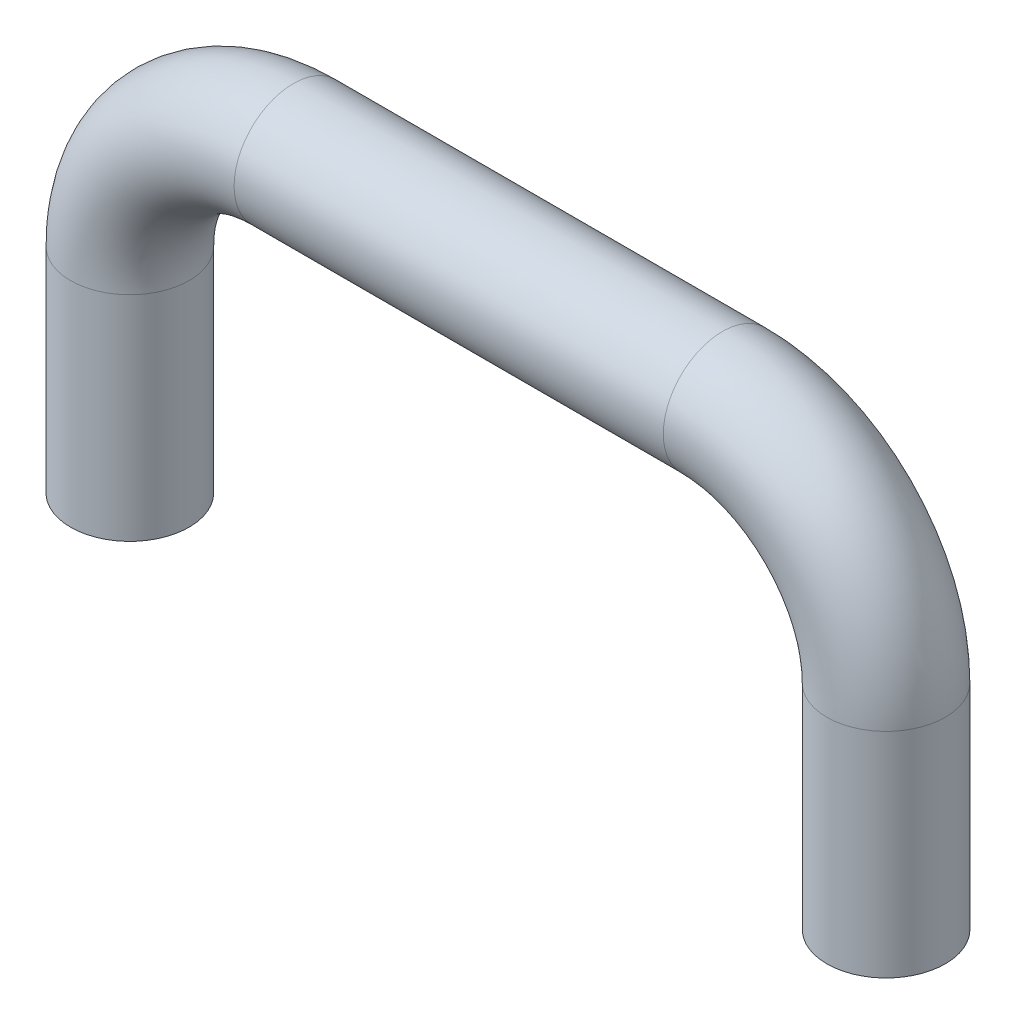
ISO-10303-21;
HEADER;
FILE_DESCRIPTION(('STEP AP214'),'2;1');
FILE_NAME('part.step','',(''),(''),'','','');
FILE_SCHEMA(('AUTOMOTIVE_DESIGN { 1 0 10303 214 1 1 1 1 }'));
ENDSEC;
DATA;
#1=APPLICATION_CONTEXT('core data for automotive mechanical design processes');
#2=APPLICATION_PROTOCOL_DEFINITION('international standard','automotive_design',2000,#1);
#3=PRODUCT_CONTEXT('',#1,'mechanical');
#4=PRODUCT('Part','Part','',(#3));
#5=PRODUCT_RELATED_PRODUCT_CATEGORY('part','',(#4));
#6=PRODUCT_DEFINITION_FORMATION('','',#4);
#7=PRODUCT_DEFINITION_CONTEXT('part definition',#1,'design');
#8=PRODUCT_DEFINITION('design','',#6,#7);
#9=PRODUCT_DEFINITION_SHAPE('','',#8);
#10=(LENGTH_UNIT() NAMED_UNIT(*) SI_UNIT(.MILLI.,.METRE.));
#11=(NAMED_UNIT(*) PLANE_ANGLE_UNIT() SI_UNIT($,.RADIAN.));
#12=(NAMED_UNIT(*) SI_UNIT($,.STERADIAN.) SOLID_ANGLE_UNIT());
#13=UNCERTAINTY_MEASURE_WITH_UNIT(LENGTH_MEASURE(1.E-05),#10,'distance_accuracy_value','');
#14=(GEOMETRIC_REPRESENTATION_CONTEXT(3) GLOBAL_UNCERTAINTY_ASSIGNED_CONTEXT((#13)) GLOBAL_UNIT_ASSIGNED_CONTEXT((#10,
#11,#12)) REPRESENTATION_CONTEXT('',''));
#15=CARTESIAN_POINT('',(0.,0.,0.));
#16=DIRECTION('',(0.,0.,1.));
#17=DIRECTION('',(1.,0.,0.));
#18=AXIS2_PLACEMENT_3D('',#15,#16,#17);
#19=CARTESIAN_POINT('',(-44.0096,-115.584,0.));
#20=DIRECTION('',(0.,-1.,0.));
#21=DIRECTION('',(0.,0.,-1.));
#22=AXIS2_PLACEMENT_3D('',#19,#20,#21);
#23=CYLINDRICAL_SURFACE('',#22,15.);
#24=CARTESIAN_POINT('',(-44.009599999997,-145.584207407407,0.));
#25=DIRECTION('',(0.,-1.,0.));
#26=DIRECTION('',(1.,0.,0.));
#27=AXIS2_PLACEMENT_3D('',#24,#25,#26);
#28=CIRCLE('',#27,15.);
#29=CARTESIAN_POINT('',(-29.009599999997,-145.584207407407,0.));
#30=VERTEX_POINT('',#29);
#31=EDGE_CURVE('E84',#30,#30,#28,.T.);
#32=ORIENTED_EDGE('',*,*,#31,.T.);
#33=EDGE_LOOP('',(#32));
#34=FACE_BOUND('',#33,.T.);
#35=CARTESIAN_POINT('',(-44.0096,-115.584,0.));
#36=DIRECTION('',(0.,-1.,0.));
#37=DIRECTION('',(0.,0.,-1.));
#38=AXIS2_PLACEMENT_3D('',#35,#36,#37);
#39=CIRCLE('',#38,15.);
#40=CARTESIAN_POINT('',(-44.0096,-115.584,-15.));
#41=VERTEX_POINT('',#40);
#42=EDGE_CURVE('E80',#41,#41,#39,.T.);
#43=ORIENTED_EDGE('',*,*,#42,.F.);
#44=EDGE_LOOP('',(#43));
#45=FACE_BOUND('',#44,.T.);
#46=ADVANCED_FACE('F30',(#34,#45),#23,.F.);
#47=CARTESIAN_POINT('',(-44.0096,-115.584,0.));
#48=DIRECTION('',(0.,-1.,0.));
#49=DIRECTION('',(0.,0.,-1.));
#50=AXIS2_PLACEMENT_3D('',#47,#48,#49);
#51=PLANE('',#50);
#52=ORIENTED_EDGE('',*,*,#42,.T.);
#53=EDGE_LOOP('',(#52));
#54=FACE_BOUND('',#53,.T.);
#55=ADVANCED_FACE('F103',(#54),#51,.T.);
#56=CARTESIAN_POINT('',(-44.0096,-41.0842074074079,0.));
#57=DIRECTION('',(0.,-1.,0.));
#58=DIRECTION('',(0.,0.,-1.));
#59=AXIS2_PLACEMENT_3D('',#56,#57,#58);
#60=CYLINDRICAL_SURFACE('',#59,29.);
#61=CARTESIAN_POINT('',(-44.0096,-41.0842074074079,0.));
#62=DIRECTION('',(0.,-1.,0.));
#63=DIRECTION('',(0.,0.,1.));
#64=AXIS2_PLACEMENT_3D('',#61,#62,#63);
#65=CIRCLE('',#64,29.);
#66=CARTESIAN_POINT('',(-44.0096,-41.0842074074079,29.));
#67=VERTEX_POINT('',#66);
#68=EDGE_CURVE('E37',#67,#67,#65,.T.);
#69=ORIENTED_EDGE('',*,*,#68,.T.);
#70=EDGE_LOOP('',(#69));
#71=FACE_BOUND('',#70,.T.);
#72=CARTESIAN_POINT('',(-44.0096,-145.584207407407,0.));
#73=DIRECTION('',(0.,-1.,0.));
#74=DIRECTION('',(0.,0.,1.));
#75=AXIS2_PLACEMENT_3D('',#72,#73,#74);
#76=CIRCLE('',#75,29.);
#77=CARTESIAN_POINT('',(-44.0096,-145.584207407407,29.));
#78=VERTEX_POINT('',#77);
#79=EDGE_CURVE('E10',#78,#78,#76,.T.);
#80=ORIENTED_EDGE('',*,*,#79,.F.);
#81=EDGE_LOOP('',(#80));
#82=FACE_BOUND('',#81,.T.);
#83=ADVANCED_FACE('F32',(#71,#82),#60,.T.);
#84=CARTESIAN_POINT('',(35.9902962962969,38.9158962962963,0.));
#85=DIRECTION('',(-1.,0.,0.));
#86=DIRECTION('',(0.,0.,1.));
#87=AXIS2_PLACEMENT_3D('',#84,#85,#86);
#88=CIRCLE('',#87,29.);
#89=CARTESIAN_POINT('',(35.9904,-41.0841037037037,0.));
#90=DIRECTION('',(0.,0.,1.));
#91=AXIS1_PLACEMENT('',#89,#90);
#92=SURFACE_OF_REVOLUTION('',#88,#91);
#93=CARTESIAN_POINT('',(35.9902962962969,38.9158962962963,29.));
#94=VERTEX_POINT('',#93);
#95=EDGE_CURVE('E41',#94,#94,#88,.T.);
#96=ORIENTED_EDGE('',*,*,#95,.T.);
#97=EDGE_LOOP('',(#96));
#98=FACE_BOUND('',#97,.T.);
#99=ORIENTED_EDGE('',*,*,#68,.F.);
#100=EDGE_LOOP('',(#99));
#101=FACE_BOUND('',#100,.T.);
#102=ADVANCED_FACE('F50',(#98,#101),#92,.F.);
#103=CARTESIAN_POINT('',(245.990296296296,38.9158962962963,0.));
#104=DIRECTION('',(-1.,0.,0.));
#105=DIRECTION('',(0.,-1.,0.));
#106=AXIS2_PLACEMENT_3D('',#103,#104,#105);
#107=CYLINDRICAL_SURFACE('',#106,29.);
#108=CARTESIAN_POINT('',(245.990296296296,38.9158962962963,0.));
#109=DIRECTION('',(-1.,0.,0.));
#110=DIRECTION('',(0.,0.,1.));
#111=AXIS2_PLACEMENT_3D('',#108,#109,#110);
#112=CIRCLE('',#111,29.);
#113=CARTESIAN_POINT('',(245.990296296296,38.9158962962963,29.));
#114=VERTEX_POINT('',#113);
#115=EDGE_CURVE('E45',#114,#114,#112,.T.);
#116=ORIENTED_EDGE('',*,*,#115,.T.);
#117=EDGE_LOOP('',(#116));
#118=FACE_BOUND('',#117,.T.);
#119=ORIENTED_EDGE('',*,*,#95,.F.);
#120=EDGE_LOOP('',(#119));
#121=FACE_BOUND('',#120,.T.);
#122=ADVANCED_FACE('F53',(#118,#121),#107,.T.);
#123=CARTESIAN_POINT('',(325.9904,-41.0840000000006,0.));
#124=DIRECTION('',(0.,1.,0.));
#125=DIRECTION('',(0.,0.,1.));
#126=AXIS2_PLACEMENT_3D('',#123,#124,#125);
#127=CIRCLE('',#126,29.);
#128=CARTESIAN_POINT('',(245.9904,-41.0841037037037,0.));
#129=DIRECTION('',(0.,0.,1.));
#130=AXIS1_PLACEMENT('',#128,#129);
#131=SURFACE_OF_REVOLUTION('',#127,#130);
#132=CARTESIAN_POINT('',(325.9904,-41.0840000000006,29.));
#133=VERTEX_POINT('',#132);
#134=EDGE_CURVE('E65',#133,#133,#127,.T.);
#135=ORIENTED_EDGE('',*,*,#134,.T.);
#136=EDGE_LOOP('',(#135));
#137=FACE_BOUND('',#136,.T.);
#138=ORIENTED_EDGE('',*,*,#115,.F.);
#139=EDGE_LOOP('',(#138));
#140=FACE_BOUND('',#139,.T.);
#141=ADVANCED_FACE('F57',(#137,#140),#131,.F.);
#142=CARTESIAN_POINT('',(325.9904,-41.0840000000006,0.));
#143=DIRECTION('',(0.,-1.,0.));
#144=DIRECTION('',(1.,0.,0.));
#145=AXIS2_PLACEMENT_3D('',#142,#143,#144);
#146=CYLINDRICAL_SURFACE('',#145,29.);
#147=ORIENTED_EDGE('',*,*,#134,.F.);
#148=EDGE_LOOP('',(#147));
#149=FACE_BOUND('',#148,.T.);
#150=CARTESIAN_POINT('',(325.9904,-145.584,0.));
#151=DIRECTION('',(0.,1.,0.));
#152=DIRECTION('',(0.,0.,1.));
#153=AXIS2_PLACEMENT_3D('',#150,#151,#152);
#154=CIRCLE('',#153,29.);
#155=CARTESIAN_POINT('',(325.9904,-145.584,29.));
#156=VERTEX_POINT('',#155);
#157=EDGE_CURVE('E69',#156,#156,#154,.T.);
#158=ORIENTED_EDGE('',*,*,#157,.T.);
#159=EDGE_LOOP('',(#158));
#160=FACE_BOUND('',#159,.T.);
#161=ADVANCED_FACE('F62',(#149,#160),#146,.T.);
#162=CARTESIAN_POINT('',(-44.0096,-145.584207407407,0.));
#163=DIRECTION('',(0.,-1.,0.));
#164=DIRECTION('',(0.,0.,1.));
#165=AXIS2_PLACEMENT_3D('',#162,#163,#164);
#166=PLANE('',#165);
#167=ORIENTED_EDGE('',*,*,#31,.F.);
#168=EDGE_LOOP('',(#167));
#169=FACE_BOUND('',#168,.T.);
#170=ORIENTED_EDGE('',*,*,#79,.T.);
#171=EDGE_LOOP('',(#170));
#172=FACE_BOUND('',#171,.T.);
#173=ADVANCED_FACE('F90',(#169,#172),#166,.T.);
#174=CARTESIAN_POINT('',(325.9904,-145.584,0.));
#175=DIRECTION('',(0.,1.,0.));
#176=DIRECTION('',(0.,0.,1.));
#177=AXIS2_PLACEMENT_3D('',#174,#175,#176);
#178=PLANE('',#177);
#179=CARTESIAN_POINT('',(325.9904,-145.584,0.));
#180=DIRECTION('',(0.,-1.,0.));
#181=DIRECTION('',(0.,0.,-1.));
#182=AXIS2_PLACEMENT_3D('',#179,#180,#181);
#183=CIRCLE('',#182,15.);
#184=CARTESIAN_POINT('',(325.9904,-145.584,-15.));
#185=VERTEX_POINT('',#184);
#186=EDGE_CURVE('E70',#185,#185,#183,.T.);
#187=ORIENTED_EDGE('',*,*,#186,.F.);
#188=EDGE_LOOP('',(#187));
#189=FACE_BOUND('',#188,.T.);
#190=ORIENTED_EDGE('',*,*,#157,.F.);
#191=EDGE_LOOP('',(#190));
#192=FACE_BOUND('',#191,.T.);
#193=ADVANCED_FACE('F92',(#189,#192),#178,.F.);
#194=CARTESIAN_POINT('',(325.9904,-115.584,0.));
#195=DIRECTION('',(0.,-1.,0.));
#196=DIRECTION('',(0.,0.,-1.));
#197=AXIS2_PLACEMENT_3D('',#194,#195,#196);
#198=CYLINDRICAL_SURFACE('',#197,15.);
#199=CARTESIAN_POINT('',(325.9904,-115.584,0.));
#200=DIRECTION('',(0.,-1.,0.));
#201=DIRECTION('',(0.,0.,-1.));
#202=AXIS2_PLACEMENT_3D('',#199,#200,#201);
#203=CIRCLE('',#202,15.);
#204=CARTESIAN_POINT('',(325.9904,-115.584,-15.));
#205=VERTEX_POINT('',#204);
#206=EDGE_CURVE('E73',#205,#205,#203,.T.);
#207=ORIENTED_EDGE('',*,*,#206,.F.);
#208=EDGE_LOOP('',(#207));
#209=FACE_BOUND('',#208,.T.);
#210=ORIENTED_EDGE('',*,*,#186,.T.);
#211=EDGE_LOOP('',(#210));
#212=FACE_BOUND('',#211,.T.);
#213=ADVANCED_FACE('F98',(#209,#212),#198,.F.);
#214=CARTESIAN_POINT('',(325.9904,-115.584,0.));
#215=DIRECTION('',(0.,-1.,0.));
#216=DIRECTION('',(0.,0.,-1.));
#217=AXIS2_PLACEMENT_3D('',#214,#215,#216);
#218=PLANE('',#217);
#219=ORIENTED_EDGE('',*,*,#206,.T.);
#220=EDGE_LOOP('',(#219));
#221=FACE_BOUND('',#220,.T.);
#222=ADVANCED_FACE('F111',(#221),#218,.T.);
#223=CLOSED_SHELL('',(#46,#55,#83,#102,#122,#141,#161,#173,#193,#213,#222));
#224=MANIFOLD_SOLID_BREP('B2',#223);
#225=ADVANCED_BREP_SHAPE_REPRESENTATION('',(#18,#224),#14);
#226=SHAPE_DEFINITION_REPRESENTATION(#9,#225);
ENDSEC;
END-ISO-10303-21;
